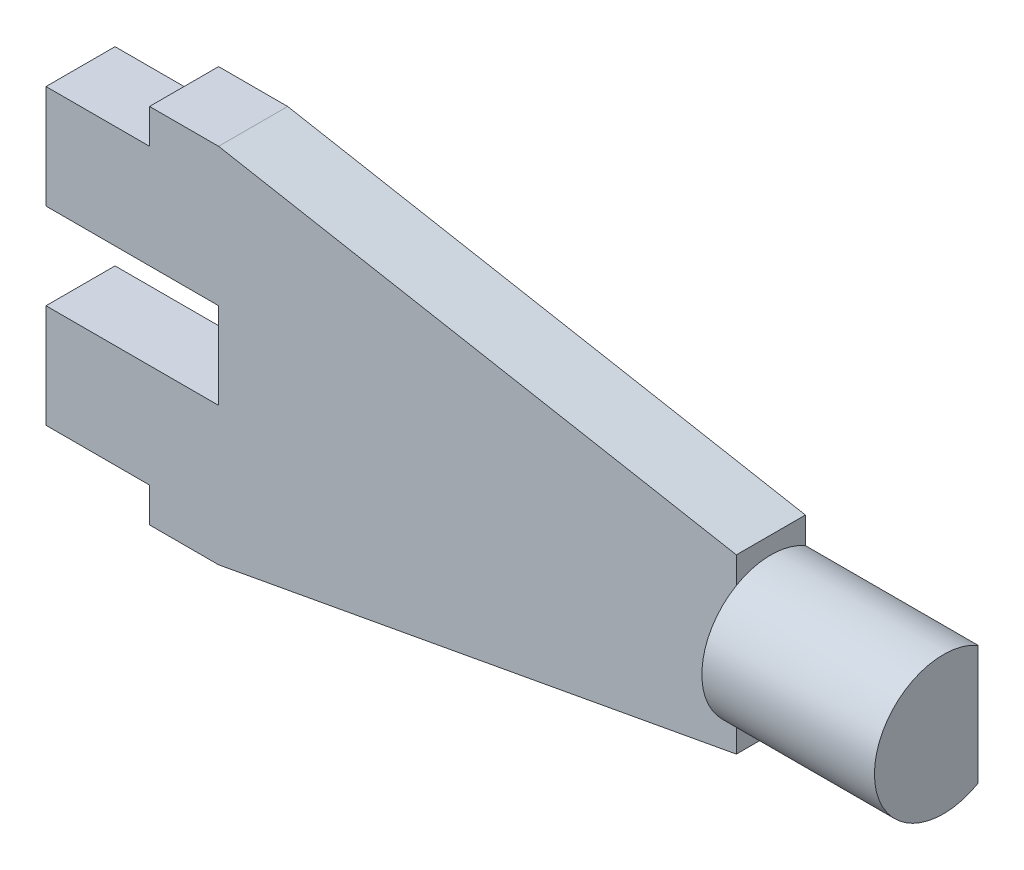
from build123d import *

# Parameters (mm, degrees)
BOSS_EXTRU_1_DEPTH      = 2
ESQUISSE2_W             = 5
ESQUISSE2_H             = 2.5
ENL_V_MAT_EXTRU_1_DEPTH = 26.623475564
ESQUISSE3_W             = 5
ESQUISSE3_H             = 5
BOSS_EXTRU_2_DEPTH      = 4
ESQUISSE4_OUTSIDE_W     = 13.554
ESQUISSE4_OUTSIDE_H     = 18.054
ENL_V_MAT_EXTRU_2_DEPTH = 5


with BuildPart() as part:
    # Esquisse1 → Boss.-Extru.1 (new body)
    with BuildSketch(Plane.XY):
        Polygon((0, -4.25), (0, 4.25), (3, 4.25), (3, 5.25), (5, 5.25), (20, 2.5), (25, 2.5), (25, -2.5), (20, -2.5), (5, -5.25), (3, -5.25), (3, -4.25), align=None)
    extrude(amount=BOSS_EXTRU_1_DEPTH)

    # Esquisse2 → Enl_v. mat.-Extru.1 (cut, through all)
    with BuildSketch(Plane.XY.offset(2)):
        with Locations((2.5, 0)):
            Rectangle(ESQUISSE2_W, ESQUISSE2_H)
    extrude(amount=-ENL_V_MAT_EXTRU_1_DEPTH, mode=Mode.SUBTRACT)

    # Esquisse3 → Boss.-Extru.2 (add)
    with BuildSketch(Plane.XY.offset(2)):
        with Locations((22.5, 0)):
            Rectangle(ESQUISSE3_W, ESQUISSE3_H)
    extrude(amount=BOSS_EXTRU_2_DEPTH)

    # Esquisse4 outside → Enl_v. mat.-Extru.2 (cut)
    with BuildSketch(Plane(origin=(25, 0, 0), x_dir=(0, 0, -1), z_dir=(1, 0, 0))):
        with Locations((-3, 0)):
            Rectangle(ESQUISSE4_OUTSIDE_W, ESQUISSE4_OUTSIDE_H)
        with BuildLine():
            Line((0, 1.732050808), (0, -1.732050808))
            ThreePointArc((0, -1.732050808), (-3, 0), (0, 1.732050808))
        make_face(mode=Mode.SUBTRACT)
    extrude(amount=-ENL_V_MAT_EXTRU_2_DEPTH, mode=Mode.SUBTRACT)


solid = part.part
